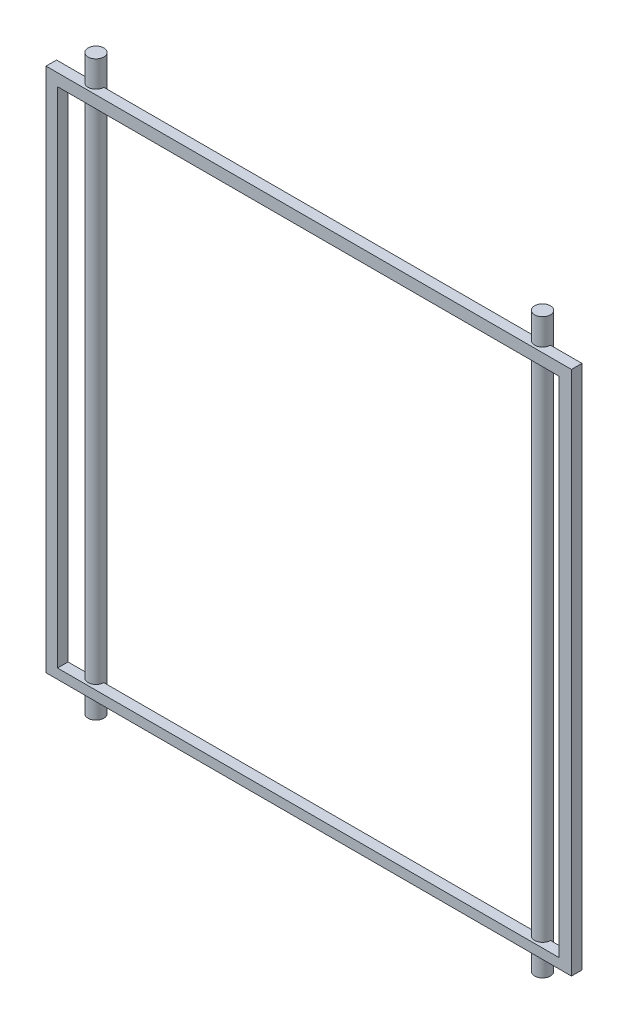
from build123d import *

# Parameters (mm, degrees)
SCHIZZO1_W             = 1000
SCHIZZO1_H             = 1000
SCHIZZO1_W_2           = 954.34058397
SCHIZZO1_H_2           = 958.259847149
ESTRUSIONE1_DEPTH      = 20
ESTRUSIONE2_DEPTH      = 970
ESTRUSIONE2_DEPTH_BACK = 120
SCHIZZO2_R             = 15


with BuildPart() as part:
    # Schizzo1 → Estrusione1 (new body)
    with BuildSketch(Plane.XY):
        with Locations((425, 420)):
            Rectangle(SCHIZZO1_W, SCHIZZO1_H)
        with Locations((424.007309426, 417.887017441)):
            Rectangle(SCHIZZO1_W_2, SCHIZZO1_H_2, mode=Mode.SUBTRACT)
    extrude(amount=ESTRUSIONE1_DEPTH)

    # Schizzo2 → Estrusione2 (add, two sides: drawn at the far end of the back side and taken through both)
    with BuildSketch(Plane(origin=(0, 0, 0), x_dir=(1, 0, 0), z_dir=(0, 1, 0)).offset(-ESTRUSIONE2_DEPTH_BACK)):
        with Locations(Location((850, 0, 0), (0, 0, 270))):
            Circle(SCHIZZO2_R)
        with Locations(Location((0, 0, 0), (0, 0, 270))):
            Circle(SCHIZZO2_R)
    extrude(amount=ESTRUSIONE2_DEPTH + ESTRUSIONE2_DEPTH_BACK)


solid = part.part
